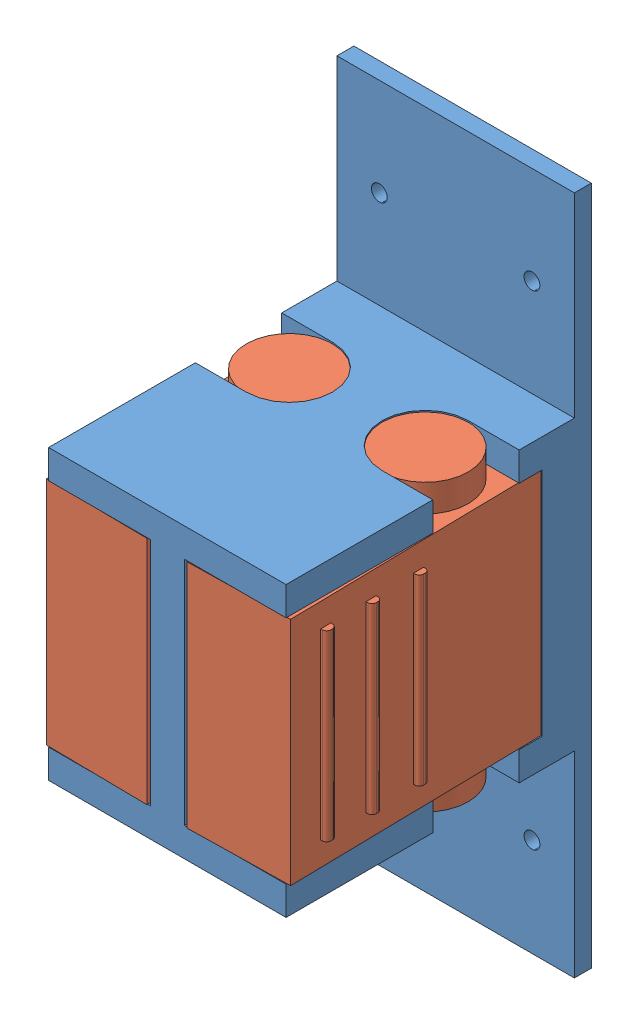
SolidWorks assembly Mad Ants Fuse Box.SLDASM, configuration Default (file format 9000). Lengths in mm.
Overall size (38.27 101.83 45.87).
3 component instances, 2 part files, 4 mates.
Components (placement in the parent):
- CB Holder-1: CB Holder.SLDPRT [Default] at (-2.5738 32.2733 34.013) size (35.56 101.83 45.72)
- Circuit Breaker-1: Circuit Breaker.SLDPRT [Default] at (7.7603 49.5453 60.567) x (0.999824 0 -0.018753) z (0 -1 0) size (17.02 38.33 42.77)
- Circuit Breaker-2: Circuit Breaker.SLDPRT [Default] at (-12.865 49.5453 60.5677) x (0.9999 0 0.014134) z (0 -1 0) size (17.02 38.33 42.77)
Mates (geometry in assembly coordinates):
- Concentric1: concentric anti-aligned: cylinder of CB Holder-1 through (7.5862 10.6833 51.285) axis (0 1 0) radius 6.4643; cylinder of Circuit Breaker-1 through (7.5862 53.6601 51.285) axis (0 -1 0) radius 6.4643
- Coincident1: coincident anti-aligned: plane of CB Holder-1 through (-0.0338 49.5453 79.733) normal (0 -1 0); plane of Circuit Breaker-1 through (7.7603 49.5453 60.567) normal (0 1 0)
- Concentric2: concentric anti-aligned: cylinder of CB Holder-1 through (-12.7338 10.6833 51.285) axis (0 1 0) radius 6.4643; cylinder of Circuit Breaker-2 through (-12.7338 53.6601 51.285) axis (0 -1 0) radius 6.4643
- Coincident2: coincident anti-aligned: plane of CB Holder-1 through (-5.1138 49.5453 41.4044) normal (0 -1 0); plane of Circuit Breaker-2 through (-12.865 49.5453 60.5677) normal (0 1 0)
